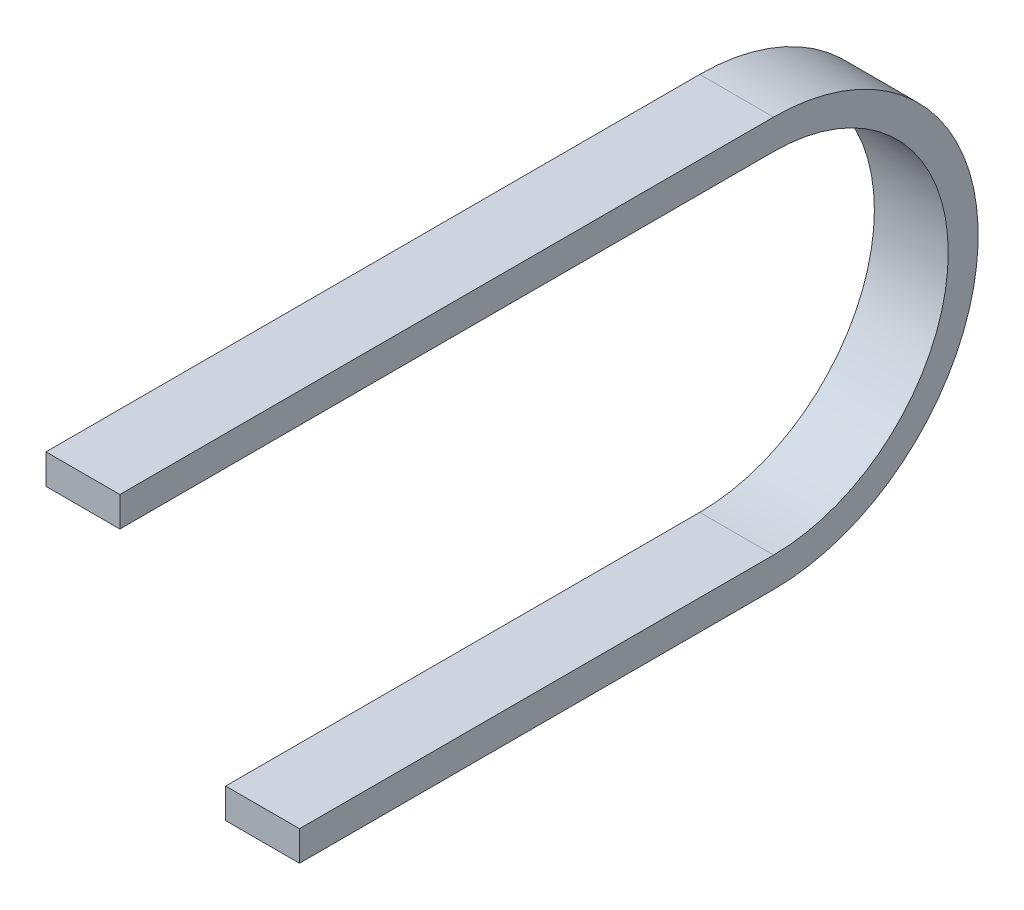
from build123d import *

# Parameters (mm, degrees)
ESQUISSE1_W = 37
ESQUISSE1_H = 15


with BuildPart() as part:
    # Balayage1: sweep along a path in Esquisse4
    with BuildLine(Plane(origin=(0, 0, 0), x_dir=(0, 0, -1), z_dir=(1, 0, 0))) as balayage1_path:
        Line((0, 0), (327.5, 0))
        ThreePointArc((327.5, 0), (422.5, -95), (327.5, -190))
        Line((327.5, -190), (90, -190))
    # Esquisse1 → Balayage1 (sweep)
    with BuildSketch(Plane.XY):
        Rectangle(ESQUISSE1_W, ESQUISSE1_H)
    sweep(path=balayage1_path.line)


solid = part.part
